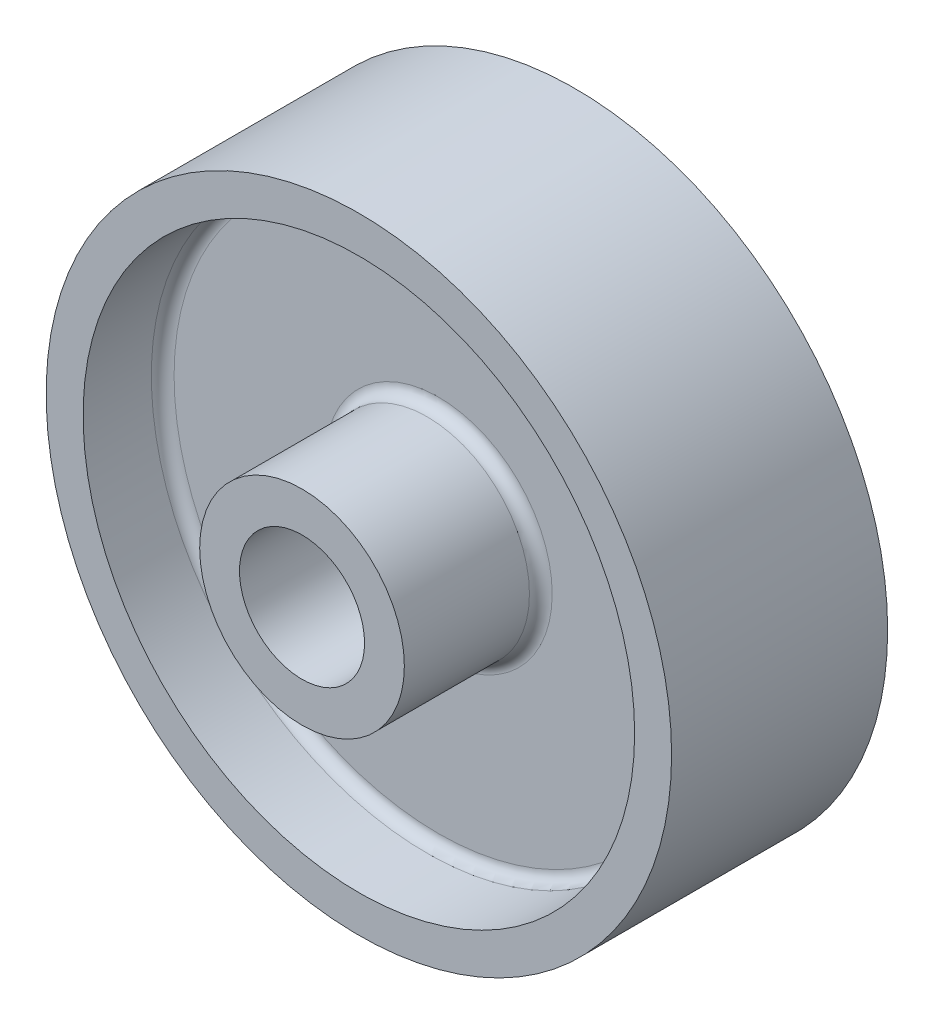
from build123d import *


with BuildPart() as part:
    # Sketch1 → Revolve1 (revolve)
    with BuildSketch(Plane(origin=(0, 0, 0), x_dir=(0, 0, -1), z_dir=(1, 0, 0)), mode=Mode.PRIVATE) as revolve1_sk:
        with BuildLine():
            Line((-29, 11), (29, 11))
            Line((29, 11), (29, 18))
            Line((29, 18), (7, 18))
            ThreePointArc((7, 18), (5.585786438, 18.585786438), (5, 20))
            Line((5, 20), (5, 46.5))
            ThreePointArc((5, 46.5), (5.585786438, 47.914213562), (7, 48.5))
            Line((7, 48.5), (19, 48.5))
            Line((19, 48.5), (19, 55))
            Line((19, 55), (-19, 55))
            Line((-19, 55), (-19, 48.5))
            Line((-19, 48.5), (-7, 48.5))
            ThreePointArc((-7, 48.5), (-5.585786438, 47.914213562), (-5, 46.5))
            Line((-5, 46.5), (-5, 20))
            ThreePointArc((-5, 20), (-5.585786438, 18.585786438), (-7, 18))
            Line((-7, 18), (-29, 18))
            Line((-29, 18), (-29, 11))
        make_face()
    revolve(revolve1_sk.sketch.rotate(Axis((0, 0, 44.460176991), (0, 0, -1)), 90), axis=Axis((0, 0, 44.460176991), (0, 0, -1)))


solid = part.part
